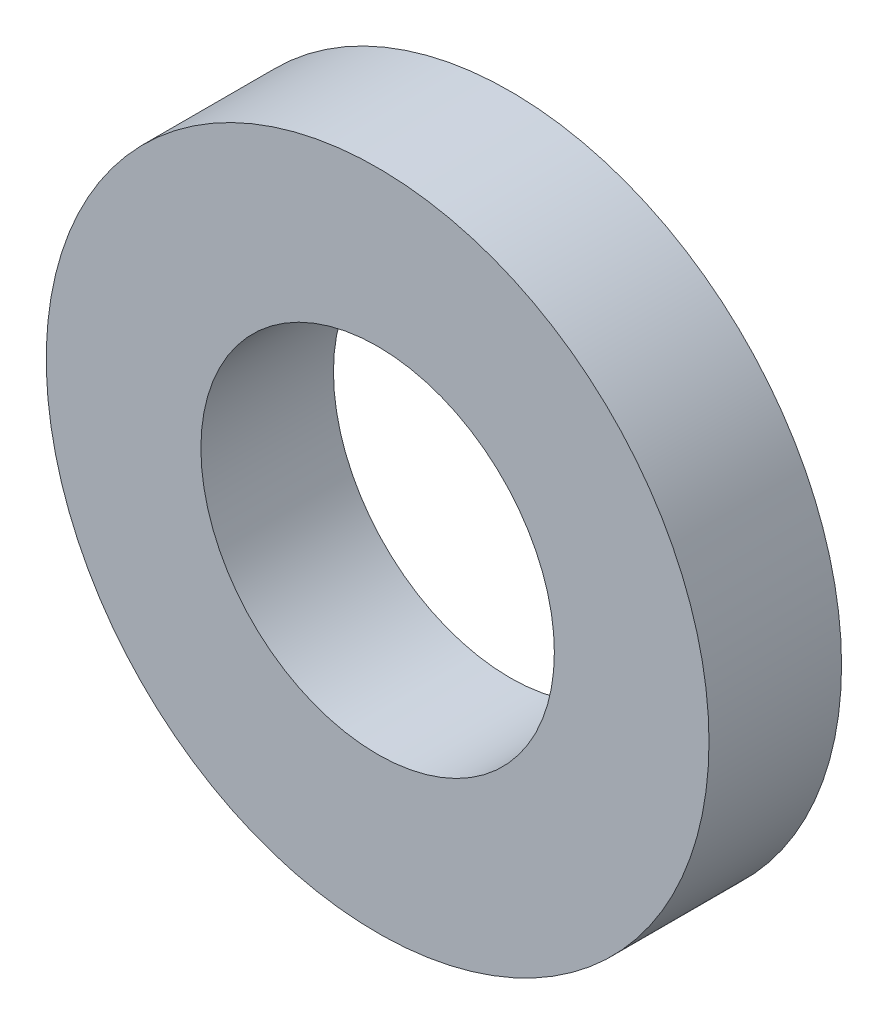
ISO-10303-21;
HEADER;
FILE_DESCRIPTION(('STEP AP214'),'2;1');
FILE_NAME('part.step','',(''),(''),'','','');
FILE_SCHEMA(('AUTOMOTIVE_DESIGN { 1 0 10303 214 1 1 1 1 }'));
ENDSEC;
DATA;
#1=APPLICATION_CONTEXT('core data for automotive mechanical design processes');
#2=APPLICATION_PROTOCOL_DEFINITION('international standard','automotive_design',2000,#1);
#3=PRODUCT_CONTEXT('',#1,'mechanical');
#4=PRODUCT('Part','Part','',(#3));
#5=PRODUCT_RELATED_PRODUCT_CATEGORY('part','',(#4));
#6=PRODUCT_DEFINITION_FORMATION('','',#4);
#7=PRODUCT_DEFINITION_CONTEXT('part definition',#1,'design');
#8=PRODUCT_DEFINITION('design','',#6,#7);
#9=PRODUCT_DEFINITION_SHAPE('','',#8);
#10=(LENGTH_UNIT() NAMED_UNIT(*) SI_UNIT(.MILLI.,.METRE.));
#11=(NAMED_UNIT(*) PLANE_ANGLE_UNIT() SI_UNIT($,.RADIAN.));
#12=(NAMED_UNIT(*) SI_UNIT($,.STERADIAN.) SOLID_ANGLE_UNIT());
#13=UNCERTAINTY_MEASURE_WITH_UNIT(LENGTH_MEASURE(1.E-05),#10,'distance_accuracy_value','');
#14=(GEOMETRIC_REPRESENTATION_CONTEXT(3) GLOBAL_UNCERTAINTY_ASSIGNED_CONTEXT((#13)) GLOBAL_UNIT_ASSIGNED_CONTEXT((#10,
#11,#12)) REPRESENTATION_CONTEXT('',''));
#15=CARTESIAN_POINT('',(0.,0.,0.));
#16=DIRECTION('',(0.,0.,1.));
#17=DIRECTION('',(1.,0.,0.));
#18=AXIS2_PLACEMENT_3D('',#15,#16,#17);
#19=CARTESIAN_POINT('',(0.,0.,1.5));
#20=DIRECTION('',(0.,0.,1.));
#21=DIRECTION('',(1.,0.,0.));
#22=AXIS2_PLACEMENT_3D('',#19,#20,#21);
#23=PLANE('',#22);
#24=CARTESIAN_POINT('',(0.,0.,1.5));
#25=DIRECTION('',(0.,0.,1.));
#26=DIRECTION('',(1.,0.,0.));
#27=AXIS2_PLACEMENT_3D('',#24,#25,#26);
#28=CIRCLE('',#27,7.5);
#29=CARTESIAN_POINT('',(7.5,0.,1.5));
#30=VERTEX_POINT('',#29);
#31=EDGE_CURVE('E10',#30,#30,#28,.T.);
#32=ORIENTED_EDGE('',*,*,#31,.T.);
#33=EDGE_LOOP('',(#32));
#34=FACE_BOUND('',#33,.T.);
#35=CARTESIAN_POINT('',(0.,0.,1.5));
#36=DIRECTION('',(0.,0.,1.));
#37=DIRECTION('',(1.,0.,0.));
#38=AXIS2_PLACEMENT_3D('',#35,#36,#37);
#39=CIRCLE('',#38,4.);
#40=CARTESIAN_POINT('',(4.,0.,1.5));
#41=VERTEX_POINT('',#40);
#42=EDGE_CURVE('E45',#41,#41,#39,.T.);
#43=ORIENTED_EDGE('',*,*,#42,.F.);
#44=EDGE_LOOP('',(#43));
#45=FACE_BOUND('',#44,.T.);
#46=ADVANCED_FACE('F34',(#34,#45),#23,.T.);
#47=CARTESIAN_POINT('',(0.,0.,-1.5));
#48=DIRECTION('',(0.,0.,1.));
#49=DIRECTION('',(1.,0.,0.));
#50=AXIS2_PLACEMENT_3D('',#47,#48,#49);
#51=PLANE('',#50);
#52=CARTESIAN_POINT('',(0.,0.,-1.5));
#53=DIRECTION('',(0.,0.,1.));
#54=DIRECTION('',(1.,0.,0.));
#55=AXIS2_PLACEMENT_3D('',#52,#53,#54);
#56=CIRCLE('',#55,7.5);
#57=CARTESIAN_POINT('',(7.5,0.,-1.5));
#58=VERTEX_POINT('',#57);
#59=EDGE_CURVE('E38',#58,#58,#56,.T.);
#60=ORIENTED_EDGE('',*,*,#59,.F.);
#61=EDGE_LOOP('',(#60));
#62=FACE_BOUND('',#61,.T.);
#63=CARTESIAN_POINT('',(0.,0.,-1.5));
#64=DIRECTION('',(0.,0.,1.));
#65=DIRECTION('',(1.,0.,0.));
#66=AXIS2_PLACEMENT_3D('',#63,#64,#65);
#67=CIRCLE('',#66,4.);
#68=CARTESIAN_POINT('',(4.,0.,-1.5));
#69=VERTEX_POINT('',#68);
#70=EDGE_CURVE('E47',#69,#69,#67,.T.);
#71=ORIENTED_EDGE('',*,*,#70,.T.);
#72=EDGE_LOOP('',(#71));
#73=FACE_BOUND('',#72,.T.);
#74=ADVANCED_FACE('F57',(#62,#73),#51,.F.);
#75=CARTESIAN_POINT('',(0.,0.,1.5));
#76=DIRECTION('',(0.,0.,-1.));
#77=DIRECTION('',(-1.,0.,0.));
#78=AXIS2_PLACEMENT_3D('',#75,#76,#77);
#79=CYLINDRICAL_SURFACE('',#78,7.5);
#80=ORIENTED_EDGE('',*,*,#31,.F.);
#81=EDGE_LOOP('',(#80));
#82=FACE_BOUND('',#81,.T.);
#83=ORIENTED_EDGE('',*,*,#59,.T.);
#84=EDGE_LOOP('',(#83));
#85=FACE_BOUND('',#84,.T.);
#86=ADVANCED_FACE('F36',(#82,#85),#79,.T.);
#87=CARTESIAN_POINT('',(0.,0.,1.5));
#88=DIRECTION('',(0.,0.,-1.));
#89=DIRECTION('',(-1.,0.,0.));
#90=AXIS2_PLACEMENT_3D('',#87,#88,#89);
#91=CYLINDRICAL_SURFACE('',#90,4.);
#92=ORIENTED_EDGE('',*,*,#42,.T.);
#93=EDGE_LOOP('',(#92));
#94=FACE_BOUND('',#93,.T.);
#95=ORIENTED_EDGE('',*,*,#70,.F.);
#96=EDGE_LOOP('',(#95));
#97=FACE_BOUND('',#96,.T.);
#98=ADVANCED_FACE('F53',(#94,#97),#91,.F.);
#99=CLOSED_SHELL('',(#46,#74,#86,#98));
#100=MANIFOLD_SOLID_BREP('B2',#99);
#101=ADVANCED_BREP_SHAPE_REPRESENTATION('',(#18,#100),#14);
#102=SHAPE_DEFINITION_REPRESENTATION(#9,#101);
ENDSEC;
END-ISO-10303-21;
